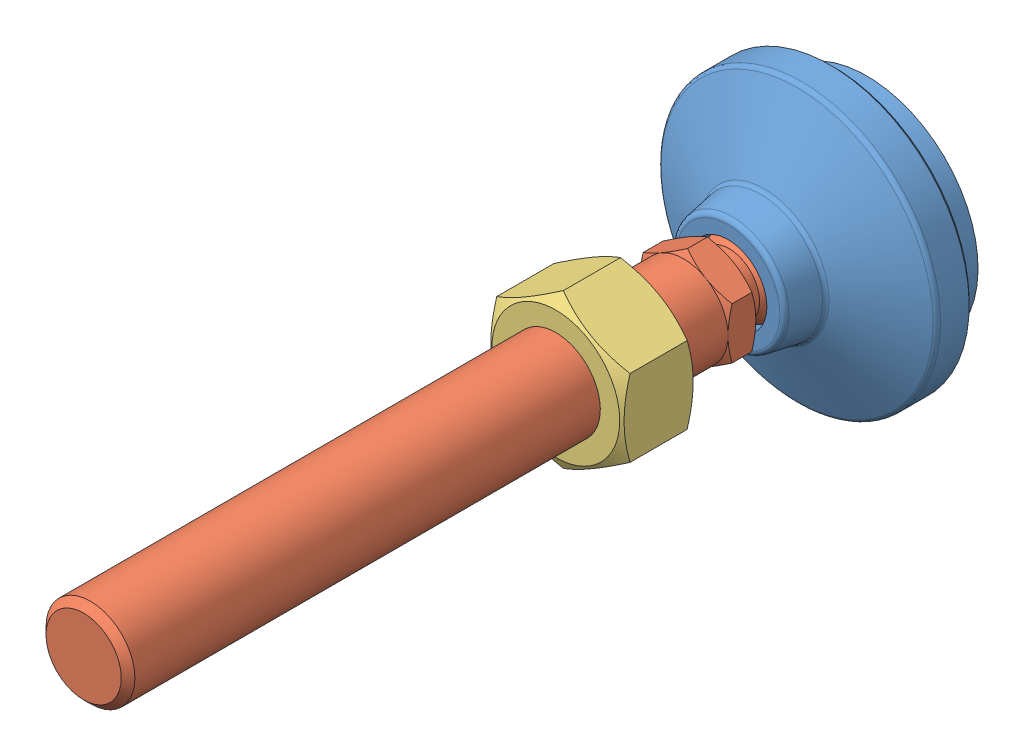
SolidWorks assembly LSVA50-M16X108.sldasm, configuration Default (file format 15000). Lengths in mm.
Overall size (50 50 141).
3 component instances, 3 part files, 0 mates.
Components (placement in the parent):
- LSVA50-M16X108_01-1: LSVA50-M16X108_01.SLDPRT [ﾃﾞﾌｫﾙﾄ] at (0 0 6) x (1 0 0) z (0 -1 0) size (50 25 50)
- LSVA50-M16X108_02-1: LSVA50-M16X108_02.SLDPRT [ﾃﾞﾌｫﾙﾄ] at (0 0 13.5) x (1 0 0) z (0 -1 0) size (16 127.5 18.48)
- LSVA50-M16X108_03-1: LSVA50-M16X108_03.SLDPRT [ﾃﾞﾌｫﾙﾄ] at (0 0 43) size (24 27.71 13)
